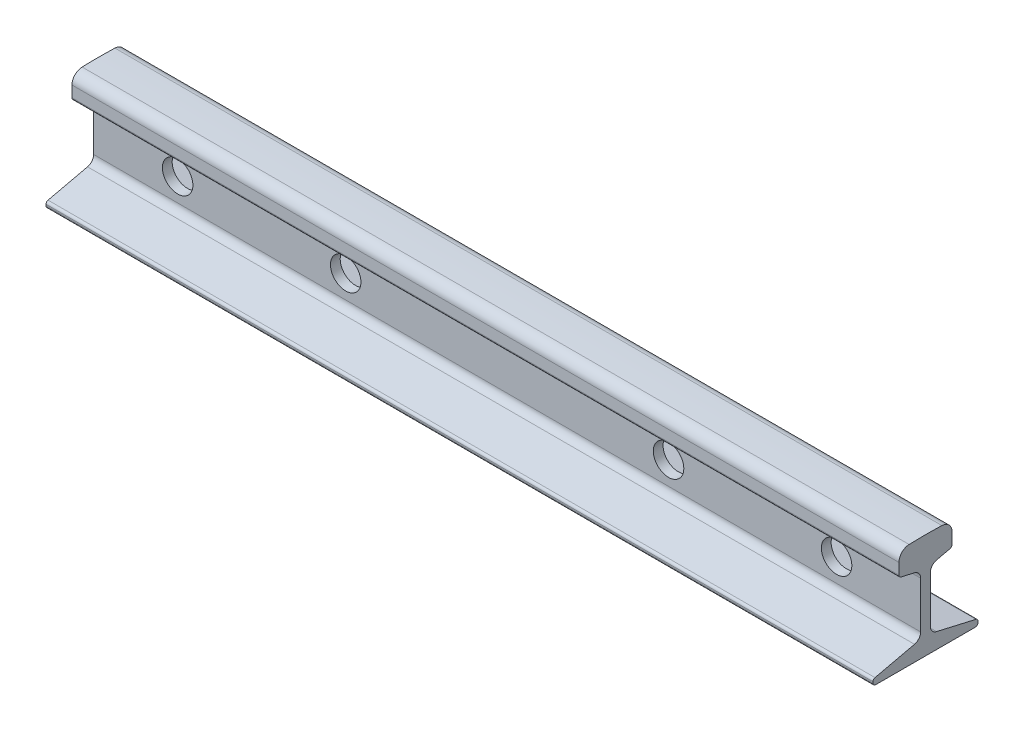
ISO-10303-21;
HEADER;
FILE_DESCRIPTION(('STEP AP214'),'2;1');
FILE_NAME('part.step','',(''),(''),'','','');
FILE_SCHEMA(('AUTOMOTIVE_DESIGN { 1 0 10303 214 1 1 1 1 }'));
ENDSEC;
DATA;
#1=APPLICATION_CONTEXT('core data for automotive mechanical design processes');
#2=APPLICATION_PROTOCOL_DEFINITION('international standard','automotive_design',2000,#1);
#3=PRODUCT_CONTEXT('',#1,'mechanical');
#4=PRODUCT('Part','Part','',(#3));
#5=PRODUCT_RELATED_PRODUCT_CATEGORY('part','',(#4));
#6=PRODUCT_DEFINITION_FORMATION('','',#4);
#7=PRODUCT_DEFINITION_CONTEXT('part definition',#1,'design');
#8=PRODUCT_DEFINITION('design','',#6,#7);
#9=PRODUCT_DEFINITION_SHAPE('','',#8);
#10=(LENGTH_UNIT() NAMED_UNIT(*) SI_UNIT(.MILLI.,.METRE.));
#11=(NAMED_UNIT(*) PLANE_ANGLE_UNIT() SI_UNIT($,.RADIAN.));
#12=(NAMED_UNIT(*) SI_UNIT($,.STERADIAN.) SOLID_ANGLE_UNIT());
#13=UNCERTAINTY_MEASURE_WITH_UNIT(LENGTH_MEASURE(1.E-05),#10,'distance_accuracy_value','');
#14=(GEOMETRIC_REPRESENTATION_CONTEXT(3) GLOBAL_UNCERTAINTY_ASSIGNED_CONTEXT((#13)) GLOBAL_UNIT_ASSIGNED_CONTEXT((#10,
#11,#12)) REPRESENTATION_CONTEXT('',''));
#15=CARTESIAN_POINT('',(0.,0.,0.));
#16=DIRECTION('',(0.,0.,1.));
#17=DIRECTION('',(1.,0.,0.));
#18=AXIS2_PLACEMENT_3D('',#15,#16,#17);
#19=CARTESIAN_POINT('',(500.,-241.3,0.));
#20=DIRECTION('',(-1.,0.,0.));
#21=DIRECTION('',(0.,0.,1.));
#22=AXIS2_PLACEMENT_3D('',#19,#20,#21);
#23=CYLINDRICAL_SURFACE('',#22,304.8);
#24=CARTESIAN_POINT('',(500.,-241.3,0.));
#25=DIRECTION('',(1.,0.,0.));
#26=DIRECTION('',(0.,0.,1.));
#27=AXIS2_PLACEMENT_3D('',#24,#25,#26);
#28=CIRCLE('',#27,304.8);
#29=CARTESIAN_POINT('',(500.,63.3389725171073,-9.90638297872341));
#30=VERTEX_POINT('',#29);
#31=CARTESIAN_POINT('',(500.,63.3389725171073,9.90638297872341));
#32=VERTEX_POINT('',#31);
#33=EDGE_CURVE('E225',#30,#32,#28,.T.);
#34=ORIENTED_EDGE('',*,*,#33,.F.);
#35=DIRECTION('',(-1.,0.,0.));
#36=VECTOR('',#35,1.);
#37=CARTESIAN_POINT('',(500.,63.3389725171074,-9.90638297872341));
#38=LINE('',#37,#36);
#39=CARTESIAN_POINT('',(0.,63.3389725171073,-9.90638297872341));
#40=VERTEX_POINT('',#39);
#41=EDGE_CURVE('E206',#30,#40,#38,.T.);
#42=ORIENTED_EDGE('',*,*,#41,.T.);
#43=CARTESIAN_POINT('',(0.,-241.3,0.));
#44=DIRECTION('',(1.,0.,0.));
#45=DIRECTION('',(0.,0.,1.));
#46=AXIS2_PLACEMENT_3D('',#43,#44,#45);
#47=CIRCLE('',#46,304.8);
#48=CARTESIAN_POINT('',(0.,63.3389725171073,9.90638297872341));
#49=VERTEX_POINT('',#48);
#50=EDGE_CURVE('E219',#40,#49,#47,.T.);
#51=ORIENTED_EDGE('',*,*,#50,.T.);
#52=DIRECTION('',(-1.,0.,0.));
#53=VECTOR('',#52,1.);
#54=CARTESIAN_POINT('',(500.,63.3389725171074,9.90638297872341));
#55=LINE('',#54,#53);
#56=EDGE_CURVE('E221',#49,#32,#55,.F.);
#57=ORIENTED_EDGE('',*,*,#56,.T.);
#58=EDGE_LOOP('',(#34,#42,#51,#57));
#59=FACE_BOUND('',#58,.T.);
#60=ADVANCED_FACE('F39',(#59),#23,.T.);
#61=CARTESIAN_POINT('',(500.,63.0771303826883,16.05));
#62=DIRECTION('',(0.,0.,-1.));
#63=DIRECTION('',(0.,1.,0.));
#64=AXIS2_PLACEMENT_3D('',#61,#62,#63);
#65=PLANE('',#64);
#66=DIRECTION('',(0.,-1.,0.));
#67=VECTOR('',#66,1.);
#68=CARTESIAN_POINT('',(0.,63.0771303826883,16.05));
#69=LINE('',#68,#67);
#70=CARTESIAN_POINT('',(0.,56.9923272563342,16.05));
#71=VERTEX_POINT('',#70);
#72=CARTESIAN_POINT('',(0.,50.3091164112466,16.05));
#73=VERTEX_POINT('',#72);
#74=EDGE_CURVE('E227',#71,#73,#69,.T.);
#75=ORIENTED_EDGE('',*,*,#74,.T.);
#76=DIRECTION('',(-1.,0.,0.));
#77=VECTOR('',#76,1.);
#78=CARTESIAN_POINT('',(500.,50.3091164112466,16.05));
#79=LINE('',#78,#77);
#80=CARTESIAN_POINT('',(500.,50.3091164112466,16.05));
#81=VERTEX_POINT('',#80);
#82=EDGE_CURVE('E348',#73,#81,#79,.F.);
#83=ORIENTED_EDGE('',*,*,#82,.T.);
#84=DIRECTION('',(0.,-1.,0.));
#85=VECTOR('',#84,1.);
#86=CARTESIAN_POINT('',(500.,63.0771303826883,16.05));
#87=LINE('',#86,#85);
#88=CARTESIAN_POINT('',(500.,56.9923272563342,16.05));
#89=VERTEX_POINT('',#88);
#90=EDGE_CURVE('E383',#89,#81,#87,.T.);
#91=ORIENTED_EDGE('',*,*,#90,.F.);
#92=DIRECTION('',(-1.,0.,0.));
#93=VECTOR('',#92,1.);
#94=CARTESIAN_POINT('',(500.,56.9923272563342,16.05));
#95=LINE('',#94,#93);
#96=EDGE_CURVE('E275',#89,#71,#95,.T.);
#97=ORIENTED_EDGE('',*,*,#96,.T.);
#98=EDGE_LOOP('',(#75,#83,#91,#97));
#99=FACE_BOUND('',#98,.T.);
#100=ADVANCED_FACE('F439',(#99),#65,.F.);
#101=CARTESIAN_POINT('',(500.,49.0443733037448,16.05));
#102=DIRECTION('',(0.,0.974370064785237,-0.224951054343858));
#103=DIRECTION('',(0.,0.224951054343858,0.974370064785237));
#104=AXIS2_PLACEMENT_3D('',#101,#102,#103);
#105=PLANE('',#104);
#106=DIRECTION('',(0.,-0.224951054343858,-0.974370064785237));
#107=VECTOR('',#106,1.);
#108=CARTESIAN_POINT('',(500.,49.0443733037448,16.05));
#109=LINE('',#108,#107);
#110=CARTESIAN_POINT('',(500.,48.7598680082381,14.8176721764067));
#111=VERTEX_POINT('',#110);
#112=CARTESIAN_POINT('',(500.,46.8717265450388,6.63923298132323));
#113=VERTEX_POINT('',#112);
#114=EDGE_CURVE('E386',#111,#113,#109,.T.);
#115=ORIENTED_EDGE('',*,*,#114,.F.);
#116=DIRECTION('',(-1.,0.,0.));
#117=VECTOR('',#116,1.);
#118=CARTESIAN_POINT('',(500.,48.7598680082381,14.8176721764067));
#119=LINE('',#118,#117);
#120=CARTESIAN_POINT('',(0.,48.7598680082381,14.8176721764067));
#121=VERTEX_POINT('',#120);
#122=EDGE_CURVE('E341',#111,#121,#119,.T.);
#123=ORIENTED_EDGE('',*,*,#122,.T.);
#124=DIRECTION('',(0.,-0.224951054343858,-0.974370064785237));
#125=VECTOR('',#124,1.);
#126=CARTESIAN_POINT('',(0.,49.0443733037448,16.05));
#127=LINE('',#126,#125);
#128=CARTESIAN_POINT('',(0.,46.8717265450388,6.63923298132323));
#129=VERTEX_POINT('',#128);
#130=EDGE_CURVE('E233',#121,#129,#127,.T.);
#131=ORIENTED_EDGE('',*,*,#130,.T.);
#132=DIRECTION('',(-1.,0.,0.));
#133=VECTOR('',#132,1.);
#134=CARTESIAN_POINT('',(500.,46.8717265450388,6.63923298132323));
#135=LINE('',#134,#133);
#136=EDGE_CURVE('E293',#129,#113,#135,.F.);
#137=ORIENTED_EDGE('',*,*,#136,.T.);
#138=EDGE_LOOP('',(#115,#123,#131,#137));
#139=FACE_BOUND('',#138,.T.);
#140=ADVANCED_FACE('F447',(#139),#105,.F.);
#141=CARTESIAN_POINT('',(500.,46.02,2.95));
#142=DIRECTION('',(0.,0.,-1.));
#143=DIRECTION('',(0.,1.,0.));
#144=AXIS2_PLACEMENT_3D('',#141,#142,#143);
#145=PLANE('',#144);
#146=CARTESIAN_POINT('',(449.20363202,27.9989725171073,2.94999999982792));
#147=DIRECTION('',(0.,0.,1.));
#148=DIRECTION('',(1.,0.,0.));
#149=AXIS2_PLACEMENT_3D('',#146,#147,#148);
#150=CIRCLE('',#149,9.21725547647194);
#151=CARTESIAN_POINT('',(458.420887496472,27.9989725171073,2.94999999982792));
#152=VERTEX_POINT('',#151);
#153=EDGE_CURVE('E378',#152,#152,#150,.T.);
#154=ORIENTED_EDGE('',*,*,#153,.F.);
#155=EDGE_LOOP('',(#154));
#156=FACE_BOUND('',#155,.T.);
#157=CARTESIAN_POINT('',(347.60363202,27.9989725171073,2.94999999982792));
#158=DIRECTION('',(0.,0.,1.));
#159=DIRECTION('',(1.,0.,0.));
#160=AXIS2_PLACEMENT_3D('',#157,#158,#159);
#161=CIRCLE('',#160,9.21725547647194);
#162=CARTESIAN_POINT('',(356.820887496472,27.9989725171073,2.94999999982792));
#163=VERTEX_POINT('',#162);
#164=EDGE_CURVE('E367',#163,#163,#161,.T.);
#165=ORIENTED_EDGE('',*,*,#164,.F.);
#166=EDGE_LOOP('',(#165));
#167=FACE_BOUND('',#166,.T.);
#168=CARTESIAN_POINT('',(152.39636798,27.9989725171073,2.94999999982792));
#169=DIRECTION('',(0.,0.,1.));
#170=DIRECTION('',(1.,0.,0.));
#171=AXIS2_PLACEMENT_3D('',#168,#169,#170);
#172=CIRCLE('',#171,9.21725547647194);
#173=CARTESIAN_POINT('',(161.613623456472,27.9989725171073,2.94999999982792));
#174=VERTEX_POINT('',#173);
#175=EDGE_CURVE('E366',#174,#174,#172,.T.);
#176=ORIENTED_EDGE('',*,*,#175,.F.);
#177=EDGE_LOOP('',(#176));
#178=FACE_BOUND('',#177,.T.);
#179=CARTESIAN_POINT('',(50.79636798,27.9989725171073,2.94999999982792));
#180=DIRECTION('',(0.,0.,1.));
#181=DIRECTION('',(1.,0.,0.));
#182=AXIS2_PLACEMENT_3D('',#179,#180,#181);
#183=CIRCLE('',#182,9.21725547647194);
#184=CARTESIAN_POINT('',(60.0136234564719,27.9989725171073,2.94999999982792));
#185=VERTEX_POINT('',#184);
#186=EDGE_CURVE('E234',#185,#185,#183,.T.);
#187=ORIENTED_EDGE('',*,*,#186,.F.);
#188=EDGE_LOOP('',(#187));
#189=FACE_BOUND('',#188,.T.);
#190=DIRECTION('',(0.,-1.,0.));
#191=VECTOR('',#190,1.);
#192=CARTESIAN_POINT('',(500.,46.02,2.95));
#193=LINE('',#192,#191);
#194=CARTESIAN_POINT('',(500.,42.2337250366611,2.95));
#195=VERTEX_POINT('',#194);
#196=CARTESIAN_POINT('',(500.,14.0862749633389,2.95));
#197=VERTEX_POINT('',#196);
#198=EDGE_CURVE('E389',#195,#197,#193,.T.);
#199=ORIENTED_EDGE('',*,*,#198,.F.);
#200=DIRECTION('',(-1.,0.,0.));
#201=VECTOR('',#200,1.);
#202=CARTESIAN_POINT('',(0.,42.2337250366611,2.95));
#203=LINE('',#202,#201);
#204=CARTESIAN_POINT('',(0.,42.2337250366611,2.95));
#205=VERTEX_POINT('',#204);
#206=EDGE_CURVE('E286',#195,#205,#203,.T.);
#207=ORIENTED_EDGE('',*,*,#206,.T.);
#208=DIRECTION('',(0.,-1.,0.));
#209=VECTOR('',#208,1.);
#210=CARTESIAN_POINT('',(0.,46.02,2.95));
#211=LINE('',#210,#209);
#212=CARTESIAN_POINT('',(0.,14.0862749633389,2.95));
#213=VERTEX_POINT('',#212);
#214=EDGE_CURVE('E241',#205,#213,#211,.T.);
#215=ORIENTED_EDGE('',*,*,#214,.T.);
#216=DIRECTION('',(-1.,0.,0.));
#217=VECTOR('',#216,1.);
#218=CARTESIAN_POINT('',(500.,14.0862749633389,2.95));
#219=LINE('',#218,#217);
#220=EDGE_CURVE('E288',#213,#197,#219,.F.);
#221=ORIENTED_EDGE('',*,*,#220,.T.);
#222=EDGE_LOOP('',(#199,#207,#215,#221));
#223=FACE_BOUND('',#222,.T.);
#224=ADVANCED_FACE('F474',(#156,#167,#178,#189,#223),#145,.F.);
#225=CARTESIAN_POINT('',(500.,10.3,2.95));
#226=DIRECTION('',(0.,-0.974370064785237,-0.224951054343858));
#227=DIRECTION('',(0.,0.224951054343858,-0.974370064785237));
#228=AXIS2_PLACEMENT_3D('',#225,#226,#227);
#229=PLANE('',#228);
#230=DIRECTION('',(0.,-0.224951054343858,0.974370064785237));
#231=VECTOR('',#230,1.);
#232=CARTESIAN_POINT('',(0.,10.3,2.95));
#233=LINE('',#232,#231);
#234=CARTESIAN_POINT('',(0.,9.44827345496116,6.63923298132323));
#235=VERTEX_POINT('',#234);
#236=CARTESIAN_POINT('',(0.,3.93550139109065,30.5176721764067));
#237=VERTEX_POINT('',#236);
#238=EDGE_CURVE('E242',#235,#237,#233,.T.);
#239=ORIENTED_EDGE('',*,*,#238,.T.);
#240=DIRECTION('',(-1.,0.,0.));
#241=VECTOR('',#240,1.);
#242=CARTESIAN_POINT('',(500.,3.93550139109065,30.5176721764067));
#243=LINE('',#242,#241);
#244=CARTESIAN_POINT('',(500.,3.93550139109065,30.5176721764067));
#245=VERTEX_POINT('',#244);
#246=EDGE_CURVE('E11',#237,#245,#243,.F.);
#247=ORIENTED_EDGE('',*,*,#246,.T.);
#248=DIRECTION('',(0.,-0.224951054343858,0.974370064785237));
#249=VECTOR('',#248,1.);
#250=CARTESIAN_POINT('',(500.,10.3,2.95));
#251=LINE('',#250,#249);
#252=CARTESIAN_POINT('',(500.,9.44827345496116,6.63923298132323));
#253=VERTEX_POINT('',#252);
#254=EDGE_CURVE('E391',#253,#245,#251,.T.);
#255=ORIENTED_EDGE('',*,*,#254,.F.);
#256=DIRECTION('',(-1.,0.,0.));
#257=VECTOR('',#256,1.);
#258=CARTESIAN_POINT('',(0.,9.44827345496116,6.63923298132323));
#259=LINE('',#258,#257);
#260=EDGE_CURVE('E295',#253,#235,#259,.T.);
#261=ORIENTED_EDGE('',*,*,#260,.T.);
#262=EDGE_LOOP('',(#239,#247,#255,#261));
#263=FACE_BOUND('',#262,.T.);
#264=ADVANCED_FACE('F485',(#263),#229,.F.);
#265=CARTESIAN_POINT('',(500.,3.65099609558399,31.75));
#266=DIRECTION('',(0.,0.,-1.));
#267=DIRECTION('',(-1.,0.,0.));
#268=AXIS2_PLACEMENT_3D('',#265,#266,#267);
#269=PLANE('',#268);
#270=DIRECTION('',(0.,-1.,0.));
#271=VECTOR('',#270,1.);
#272=CARTESIAN_POINT('',(0.,3.65099609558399,31.75));
#273=LINE('',#272,#271);
#274=CARTESIAN_POINT('',(0.,2.38625298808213,31.75));
#275=VERTEX_POINT('',#274);
#276=CARTESIAN_POINT('',(0.,1.59,31.75));
#277=VERTEX_POINT('',#276);
#278=EDGE_CURVE('E250',#275,#277,#273,.T.);
#279=ORIENTED_EDGE('',*,*,#278,.T.);
#280=DIRECTION('',(-1.,0.,0.));
#281=VECTOR('',#280,1.);
#282=CARTESIAN_POINT('',(500.,1.59,31.75));
#283=LINE('',#282,#281);
#284=CARTESIAN_POINT('',(500.,1.59,31.75));
#285=VERTEX_POINT('',#284);
#286=EDGE_CURVE('E48',#277,#285,#283,.F.);
#287=ORIENTED_EDGE('',*,*,#286,.T.);
#288=DIRECTION('',(0.,-1.,0.));
#289=VECTOR('',#288,1.);
#290=CARTESIAN_POINT('',(500.,3.65099609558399,31.75));
#291=LINE('',#290,#289);
#292=CARTESIAN_POINT('',(500.,2.38625298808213,31.75));
#293=VERTEX_POINT('',#292);
#294=EDGE_CURVE('E398',#293,#285,#291,.T.);
#295=ORIENTED_EDGE('',*,*,#294,.F.);
#296=DIRECTION('',(-1.,0.,0.));
#297=VECTOR('',#296,1.);
#298=CARTESIAN_POINT('',(500.,2.38625298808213,31.75));
#299=LINE('',#298,#297);
#300=EDGE_CURVE('E359',#293,#275,#299,.T.);
#301=ORIENTED_EDGE('',*,*,#300,.T.);
#302=EDGE_LOOP('',(#279,#287,#295,#301));
#303=FACE_BOUND('',#302,.T.);
#304=ADVANCED_FACE('F489',(#303),#269,.F.);
#305=CARTESIAN_POINT('',(500.,0.,-31.75));
#306=DIRECTION('',(0.,1.,0.));
#307=DIRECTION('',(0.,0.,1.));
#308=AXIS2_PLACEMENT_3D('',#305,#306,#307);
#309=PLANE('',#308);
#310=DIRECTION('',(0.,0.,-1.));
#311=VECTOR('',#310,1.);
#312=CARTESIAN_POINT('',(0.,0.,-31.75));
#313=LINE('',#312,#311);
#314=CARTESIAN_POINT('',(0.,0.,30.16));
#315=VERTEX_POINT('',#314);
#316=CARTESIAN_POINT('',(0.,0.,-30.16));
#317=VERTEX_POINT('',#316);
#318=EDGE_CURVE('E249',#315,#317,#313,.T.);
#319=ORIENTED_EDGE('',*,*,#318,.T.);
#320=DIRECTION('',(-1.,0.,0.));
#321=VECTOR('',#320,1.);
#322=CARTESIAN_POINT('',(500.,0.,-30.16));
#323=LINE('',#322,#321);
#324=CARTESIAN_POINT('',(500.,0.,-30.16));
#325=VERTEX_POINT('',#324);
#326=EDGE_CURVE('E352',#317,#325,#323,.F.);
#327=ORIENTED_EDGE('',*,*,#326,.T.);
#328=DIRECTION('',(0.,0.,-1.));
#329=VECTOR('',#328,1.);
#330=CARTESIAN_POINT('',(500.,0.,-31.75));
#331=LINE('',#330,#329);
#332=CARTESIAN_POINT('',(500.,0.,30.16));
#333=VERTEX_POINT('',#332);
#334=EDGE_CURVE('E399',#333,#325,#331,.T.);
#335=ORIENTED_EDGE('',*,*,#334,.F.);
#336=DIRECTION('',(-1.,0.,0.));
#337=VECTOR('',#336,1.);
#338=CARTESIAN_POINT('',(500.,0.,30.16));
#339=LINE('',#338,#337);
#340=EDGE_CURVE('E355',#333,#315,#339,.T.);
#341=ORIENTED_EDGE('',*,*,#340,.T.);
#342=EDGE_LOOP('',(#319,#327,#335,#341));
#343=FACE_BOUND('',#342,.T.);
#344=ADVANCED_FACE('F497',(#343),#309,.F.);
#345=CARTESIAN_POINT('',(500.,3.65099609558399,-31.75));
#346=DIRECTION('',(0.,0.,1.));
#347=DIRECTION('',(1.,0.,0.));
#348=AXIS2_PLACEMENT_3D('',#345,#346,#347);
#349=PLANE('',#348);
#350=DIRECTION('',(0.,1.,0.));
#351=VECTOR('',#350,1.);
#352=CARTESIAN_POINT('',(500.,3.65099609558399,-31.75));
#353=LINE('',#352,#351);
#354=CARTESIAN_POINT('',(500.,1.59,-31.75));
#355=VERTEX_POINT('',#354);
#356=CARTESIAN_POINT('',(500.,2.38625298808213,-31.75));
#357=VERTEX_POINT('',#356);
#358=EDGE_CURVE('E405',#355,#357,#353,.T.);
#359=ORIENTED_EDGE('',*,*,#358,.F.);
#360=DIRECTION('',(-1.,0.,0.));
#361=VECTOR('',#360,1.);
#362=CARTESIAN_POINT('',(500.,1.59,-31.75));
#363=LINE('',#362,#361);
#364=CARTESIAN_POINT('',(0.,1.59,-31.75));
#365=VERTEX_POINT('',#364);
#366=EDGE_CURVE('E349',#355,#365,#363,.T.);
#367=ORIENTED_EDGE('',*,*,#366,.T.);
#368=DIRECTION('',(0.,1.,0.));
#369=VECTOR('',#368,1.);
#370=CARTESIAN_POINT('',(0.,3.65099609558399,-31.75));
#371=LINE('',#370,#369);
#372=CARTESIAN_POINT('',(0.,2.38625298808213,-31.75));
#373=VERTEX_POINT('',#372);
#374=EDGE_CURVE('E254',#365,#373,#371,.T.);
#375=ORIENTED_EDGE('',*,*,#374,.T.);
#376=DIRECTION('',(-1.,0.,0.));
#377=VECTOR('',#376,1.);
#378=CARTESIAN_POINT('',(500.,2.38625298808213,-31.75));
#379=LINE('',#378,#377);
#380=EDGE_CURVE('E62',#373,#357,#379,.F.);
#381=ORIENTED_EDGE('',*,*,#380,.T.);
#382=EDGE_LOOP('',(#359,#367,#375,#381));
#383=FACE_BOUND('',#382,.T.);
#384=ADVANCED_FACE('F502',(#383),#349,.F.);
#385=CARTESIAN_POINT('',(500.,10.3,-2.95));
#386=DIRECTION('',(0.,-0.974370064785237,0.224951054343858));
#387=DIRECTION('',(0.,-0.224951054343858,-0.974370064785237));
#388=AXIS2_PLACEMENT_3D('',#385,#386,#387);
#389=PLANE('',#388);
#390=DIRECTION('',(0.,0.224951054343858,0.974370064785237));
#391=VECTOR('',#390,1.);
#392=CARTESIAN_POINT('',(500.,10.3,-2.95));
#393=LINE('',#392,#391);
#394=CARTESIAN_POINT('',(500.,3.93550139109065,-30.5176721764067));
#395=VERTEX_POINT('',#394);
#396=CARTESIAN_POINT('',(500.,9.44827345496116,-6.63923298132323));
#397=VERTEX_POINT('',#396);
#398=EDGE_CURVE('E404',#395,#397,#393,.T.);
#399=ORIENTED_EDGE('',*,*,#398,.F.);
#400=DIRECTION('',(-1.,0.,0.));
#401=VECTOR('',#400,1.);
#402=CARTESIAN_POINT('',(500.,3.93550139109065,-30.5176721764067));
#403=LINE('',#402,#401);
#404=CARTESIAN_POINT('',(0.,3.93550139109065,-30.5176721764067));
#405=VERTEX_POINT('',#404);
#406=EDGE_CURVE('E357',#395,#405,#403,.T.);
#407=ORIENTED_EDGE('',*,*,#406,.T.);
#408=DIRECTION('',(0.,0.224951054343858,0.974370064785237));
#409=VECTOR('',#408,1.);
#410=CARTESIAN_POINT('',(0.,10.3,-2.95));
#411=LINE('',#410,#409);
#412=CARTESIAN_POINT('',(0.,9.44827345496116,-6.63923298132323));
#413=VERTEX_POINT('',#412);
#414=EDGE_CURVE('E253',#405,#413,#411,.T.);
#415=ORIENTED_EDGE('',*,*,#414,.T.);
#416=DIRECTION('',(-1.,0.,0.));
#417=VECTOR('',#416,1.);
#418=CARTESIAN_POINT('',(500.,9.44827345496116,-6.63923298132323));
#419=LINE('',#418,#417);
#420=EDGE_CURVE('E281',#413,#397,#419,.F.);
#421=ORIENTED_EDGE('',*,*,#420,.T.);
#422=EDGE_LOOP('',(#399,#407,#415,#421));
#423=FACE_BOUND('',#422,.T.);
#424=ADVANCED_FACE('F512',(#423),#389,.F.);
#425=CARTESIAN_POINT('',(500.,46.02,-2.95));
#426=DIRECTION('',(0.,0.,1.));
#427=DIRECTION('',(0.,-1.,0.));
#428=AXIS2_PLACEMENT_3D('',#425,#426,#427);
#429=PLANE('',#428);
#430=CARTESIAN_POINT('',(449.20363202,27.9989725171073,-2.95));
#431=DIRECTION('',(0.,0.,1.));
#432=DIRECTION('',(0.,-1.,0.));
#433=AXIS2_PLACEMENT_3D('',#430,#431,#432);
#434=CIRCLE('',#433,9.21725547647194);
#435=CARTESIAN_POINT('',(449.20363202,18.7817170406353,-2.95));
#436=VERTEX_POINT('',#435);
#437=EDGE_CURVE('E43',#436,#436,#434,.T.);
#438=ORIENTED_EDGE('',*,*,#437,.T.);
#439=EDGE_LOOP('',(#438));
#440=FACE_BOUND('',#439,.T.);
#441=CARTESIAN_POINT('',(347.60363202,27.9989725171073,-2.95));
#442=DIRECTION('',(0.,0.,1.));
#443=DIRECTION('',(0.,-1.,0.));
#444=AXIS2_PLACEMENT_3D('',#441,#442,#443);
#445=CIRCLE('',#444,9.21725547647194);
#446=CARTESIAN_POINT('',(347.60363202,18.7817170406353,-2.95));
#447=VERTEX_POINT('',#446);
#448=EDGE_CURVE('E370',#447,#447,#445,.T.);
#449=ORIENTED_EDGE('',*,*,#448,.T.);
#450=EDGE_LOOP('',(#449));
#451=FACE_BOUND('',#450,.T.);
#452=CARTESIAN_POINT('',(152.39636798,27.9989725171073,-2.95));
#453=DIRECTION('',(0.,0.,1.));
#454=DIRECTION('',(0.,-1.,0.));
#455=AXIS2_PLACEMENT_3D('',#452,#453,#454);
#456=CIRCLE('',#455,9.21725547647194);
#457=CARTESIAN_POINT('',(152.39636798,18.7817170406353,-2.95));
#458=VERTEX_POINT('',#457);
#459=EDGE_CURVE('E364',#458,#458,#456,.T.);
#460=ORIENTED_EDGE('',*,*,#459,.T.);
#461=EDGE_LOOP('',(#460));
#462=FACE_BOUND('',#461,.T.);
#463=CARTESIAN_POINT('',(50.79636798,27.9989725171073,-2.95));
#464=DIRECTION('',(0.,0.,1.));
#465=DIRECTION('',(0.,-1.,0.));
#466=AXIS2_PLACEMENT_3D('',#463,#464,#465);
#467=CIRCLE('',#466,9.21725547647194);
#468=CARTESIAN_POINT('',(50.79636798,18.7817170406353,-2.95));
#469=VERTEX_POINT('',#468);
#470=EDGE_CURVE('E226',#469,#469,#467,.T.);
#471=ORIENTED_EDGE('',*,*,#470,.T.);
#472=EDGE_LOOP('',(#471));
#473=FACE_BOUND('',#472,.T.);
#474=DIRECTION('',(0.,1.,0.));
#475=VECTOR('',#474,1.);
#476=CARTESIAN_POINT('',(0.,46.02,-2.95));
#477=LINE('',#476,#475);
#478=CARTESIAN_POINT('',(0.,14.0862749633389,-2.95));
#479=VERTEX_POINT('',#478);
#480=CARTESIAN_POINT('',(0.,42.2337250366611,-2.95));
#481=VERTEX_POINT('',#480);
#482=EDGE_CURVE('E260',#479,#481,#477,.T.);
#483=ORIENTED_EDGE('',*,*,#482,.T.);
#484=DIRECTION('',(-1.,0.,0.));
#485=VECTOR('',#484,1.);
#486=CARTESIAN_POINT('',(500.,42.2337250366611,-2.95));
#487=LINE('',#486,#485);
#488=CARTESIAN_POINT('',(500.,42.2337250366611,-2.95));
#489=VERTEX_POINT('',#488);
#490=EDGE_CURVE('E283',#481,#489,#487,.F.);
#491=ORIENTED_EDGE('',*,*,#490,.T.);
#492=DIRECTION('',(0.,1.,0.));
#493=VECTOR('',#492,1.);
#494=CARTESIAN_POINT('',(500.,46.02,-2.95));
#495=LINE('',#494,#493);
#496=CARTESIAN_POINT('',(500.,14.0862749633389,-2.95));
#497=VERTEX_POINT('',#496);
#498=EDGE_CURVE('E408',#497,#489,#495,.T.);
#499=ORIENTED_EDGE('',*,*,#498,.F.);
#500=DIRECTION('',(-1.,0.,0.));
#501=VECTOR('',#500,1.);
#502=CARTESIAN_POINT('',(0.,14.0862749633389,-2.95));
#503=LINE('',#502,#501);
#504=EDGE_CURVE('E276',#497,#479,#503,.T.);
#505=ORIENTED_EDGE('',*,*,#504,.T.);
#506=EDGE_LOOP('',(#483,#491,#499,#505));
#507=FACE_BOUND('',#506,.T.);
#508=ADVANCED_FACE('F516',(#440,#451,#462,#473,#507),#429,.F.);
#509=CARTESIAN_POINT('',(500.,49.0443733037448,-16.05));
#510=DIRECTION('',(0.,0.974370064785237,0.224951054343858));
#511=DIRECTION('',(0.,-0.224951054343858,0.974370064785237));
#512=AXIS2_PLACEMENT_3D('',#509,#510,#511);
#513=PLANE('',#512);
#514=DIRECTION('',(0.,0.224951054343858,-0.974370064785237));
#515=VECTOR('',#514,1.);
#516=CARTESIAN_POINT('',(0.,49.0443733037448,-16.05));
#517=LINE('',#516,#515);
#518=CARTESIAN_POINT('',(0.,46.8717265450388,-6.63923298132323));
#519=VERTEX_POINT('',#518);
#520=CARTESIAN_POINT('',(0.,48.7598680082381,-14.8176721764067));
#521=VERTEX_POINT('',#520);
#522=EDGE_CURVE('E259',#519,#521,#517,.T.);
#523=ORIENTED_EDGE('',*,*,#522,.T.);
#524=DIRECTION('',(-1.,0.,0.));
#525=VECTOR('',#524,1.);
#526=CARTESIAN_POINT('',(500.,48.7598680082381,-14.8176721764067));
#527=LINE('',#526,#525);
#528=CARTESIAN_POINT('',(500.,48.7598680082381,-14.8176721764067));
#529=VERTEX_POINT('',#528);
#530=EDGE_CURVE('E327',#521,#529,#527,.F.);
#531=ORIENTED_EDGE('',*,*,#530,.T.);
#532=DIRECTION('',(0.,0.224951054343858,-0.974370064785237));
#533=VECTOR('',#532,1.);
#534=CARTESIAN_POINT('',(500.,49.0443733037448,-16.05));
#535=LINE('',#534,#533);
#536=CARTESIAN_POINT('',(500.,46.8717265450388,-6.63923298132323));
#537=VERTEX_POINT('',#536);
#538=EDGE_CURVE('E406',#537,#529,#535,.T.);
#539=ORIENTED_EDGE('',*,*,#538,.F.);
#540=DIRECTION('',(-1.,0.,0.));
#541=VECTOR('',#540,1.);
#542=CARTESIAN_POINT('',(0.,46.8717265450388,-6.63923298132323));
#543=LINE('',#542,#541);
#544=EDGE_CURVE('E273',#537,#519,#543,.T.);
#545=ORIENTED_EDGE('',*,*,#544,.T.);
#546=EDGE_LOOP('',(#523,#531,#539,#545));
#547=FACE_BOUND('',#546,.T.);
#548=ADVANCED_FACE('F423',(#547),#513,.F.);
#549=CARTESIAN_POINT('',(500.,63.0771303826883,-16.05));
#550=DIRECTION('',(0.,0.,1.));
#551=DIRECTION('',(0.,-1.,0.));
#552=AXIS2_PLACEMENT_3D('',#549,#550,#551);
#553=PLANE('',#552);
#554=DIRECTION('',(0.,1.,0.));
#555=VECTOR('',#554,1.);
#556=CARTESIAN_POINT('',(500.,63.0771303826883,-16.05));
#557=LINE('',#556,#555);
#558=CARTESIAN_POINT('',(500.,50.3091164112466,-16.05));
#559=VERTEX_POINT('',#558);
#560=CARTESIAN_POINT('',(500.,56.9923272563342,-16.05));
#561=VERTEX_POINT('',#560);
#562=EDGE_CURVE('E240',#559,#561,#557,.T.);
#563=ORIENTED_EDGE('',*,*,#562,.F.);
#564=DIRECTION('',(-1.,0.,0.));
#565=VECTOR('',#564,1.);
#566=CARTESIAN_POINT('',(500.,50.3091164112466,-16.05));
#567=LINE('',#566,#565);
#568=CARTESIAN_POINT('',(0.,50.3091164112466,-16.05));
#569=VERTEX_POINT('',#568);
#570=EDGE_CURVE('E314',#559,#569,#567,.T.);
#571=ORIENTED_EDGE('',*,*,#570,.T.);
#572=DIRECTION('',(0.,1.,0.));
#573=VECTOR('',#572,1.);
#574=CARTESIAN_POINT('',(0.,63.0771303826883,-16.05));
#575=LINE('',#574,#573);
#576=CARTESIAN_POINT('',(0.,56.9923272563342,-16.05));
#577=VERTEX_POINT('',#576);
#578=EDGE_CURVE('E261',#569,#577,#575,.T.);
#579=ORIENTED_EDGE('',*,*,#578,.T.);
#580=DIRECTION('',(-1.,0.,0.));
#581=VECTOR('',#580,1.);
#582=CARTESIAN_POINT('',(500.,56.9923272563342,-16.05));
#583=LINE('',#582,#581);
#584=EDGE_CURVE('E208',#577,#561,#583,.F.);
#585=ORIENTED_EDGE('',*,*,#584,.T.);
#586=EDGE_LOOP('',(#563,#571,#579,#585));
#587=FACE_BOUND('',#586,.T.);
#588=ADVANCED_FACE('F418',(#587),#553,.F.);
#589=CARTESIAN_POINT('',(500.,-241.3,0.));
#590=DIRECTION('',(-1.,0.,0.));
#591=DIRECTION('',(0.,0.,1.));
#592=AXIS2_PLACEMENT_3D('',#589,#590,#591);
#593=PLANE('',#592);
#594=ORIENTED_EDGE('',*,*,#538,.T.);
#595=CARTESIAN_POINT('',(500.,50.3091164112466,-14.46));
#596=DIRECTION('',(-1.,0.,0.));
#597=DIRECTION('',(0.,0.,1.));
#598=AXIS2_PLACEMENT_3D('',#595,#596,#597);
#599=CIRCLE('',#598,1.59);
#600=EDGE_CURVE('E343',#529,#559,#599,.F.);
#601=ORIENTED_EDGE('',*,*,#600,.T.);
#602=ORIENTED_EDGE('',*,*,#562,.T.);
#603=CARTESIAN_POINT('',(500.,56.9923272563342,-9.7));
#604=DIRECTION('',(-1.,0.,0.));
#605=DIRECTION('',(0.,0.,1.));
#606=AXIS2_PLACEMENT_3D('',#603,#604,#605);
#607=CIRCLE('',#606,6.35);
#608=EDGE_CURVE('E267',#561,#30,#607,.F.);
#609=ORIENTED_EDGE('',*,*,#608,.T.);
#610=ORIENTED_EDGE('',*,*,#33,.T.);
#611=CARTESIAN_POINT('',(500.,56.9923272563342,9.7));
#612=DIRECTION('',(-1.,0.,0.));
#613=DIRECTION('',(0.,0.,1.));
#614=AXIS2_PLACEMENT_3D('',#611,#612,#613);
#615=CIRCLE('',#614,6.35);
#616=EDGE_CURVE('E266',#32,#89,#615,.F.);
#617=ORIENTED_EDGE('',*,*,#616,.T.);
#618=ORIENTED_EDGE('',*,*,#90,.T.);
#619=CARTESIAN_POINT('',(500.,50.3091164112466,14.46));
#620=DIRECTION('',(-1.,0.,0.));
#621=DIRECTION('',(0.,0.,1.));
#622=AXIS2_PLACEMENT_3D('',#619,#620,#621);
#623=CIRCLE('',#622,1.59);
#624=EDGE_CURVE('E339',#81,#111,#623,.F.);
#625=ORIENTED_EDGE('',*,*,#624,.T.);
#626=ORIENTED_EDGE('',*,*,#114,.T.);
#627=CARTESIAN_POINT('',(500.,42.2337250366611,7.71));
#628=DIRECTION('',(-1.,0.,0.));
#629=DIRECTION('',(0.,0.,1.));
#630=AXIS2_PLACEMENT_3D('',#627,#628,#629);
#631=CIRCLE('',#630,4.76);
#632=EDGE_CURVE('E307',#113,#195,#631,.T.);
#633=ORIENTED_EDGE('',*,*,#632,.T.);
#634=ORIENTED_EDGE('',*,*,#198,.T.);
#635=CARTESIAN_POINT('',(500.,14.0862749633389,7.71));
#636=DIRECTION('',(-1.,0.,0.));
#637=DIRECTION('',(0.,0.,1.));
#638=AXIS2_PLACEMENT_3D('',#635,#636,#637);
#639=CIRCLE('',#638,4.76);
#640=EDGE_CURVE('E312',#197,#253,#639,.T.);
#641=ORIENTED_EDGE('',*,*,#640,.T.);
#642=ORIENTED_EDGE('',*,*,#254,.T.);
#643=CARTESIAN_POINT('',(500.,2.38625298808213,30.16));
#644=DIRECTION('',(-1.,0.,0.));
#645=DIRECTION('',(0.,0.,1.));
#646=AXIS2_PLACEMENT_3D('',#643,#644,#645);
#647=CIRCLE('',#646,1.59);
#648=EDGE_CURVE('E335',#245,#293,#647,.F.);
#649=ORIENTED_EDGE('',*,*,#648,.T.);
#650=ORIENTED_EDGE('',*,*,#294,.T.);
#651=CARTESIAN_POINT('',(500.,1.59,30.16));
#652=DIRECTION('',(-1.,0.,0.));
#653=DIRECTION('',(0.,0.,1.));
#654=AXIS2_PLACEMENT_3D('',#651,#652,#653);
#655=CIRCLE('',#654,1.59);
#656=EDGE_CURVE('E334',#285,#333,#655,.F.);
#657=ORIENTED_EDGE('',*,*,#656,.T.);
#658=ORIENTED_EDGE('',*,*,#334,.T.);
#659=CARTESIAN_POINT('',(500.,1.59,-30.16));
#660=DIRECTION('',(-1.,0.,0.));
#661=DIRECTION('',(0.,0.,1.));
#662=AXIS2_PLACEMENT_3D('',#659,#660,#661);
#663=CIRCLE('',#662,1.59);
#664=EDGE_CURVE('E340',#325,#355,#663,.F.);
#665=ORIENTED_EDGE('',*,*,#664,.T.);
#666=ORIENTED_EDGE('',*,*,#358,.T.);
#667=CARTESIAN_POINT('',(500.,2.38625298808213,-30.16));
#668=DIRECTION('',(-1.,0.,0.));
#669=DIRECTION('',(0.,0.,1.));
#670=AXIS2_PLACEMENT_3D('',#667,#668,#669);
#671=CIRCLE('',#670,1.59);
#672=EDGE_CURVE('E57',#357,#395,#671,.F.);
#673=ORIENTED_EDGE('',*,*,#672,.T.);
#674=ORIENTED_EDGE('',*,*,#398,.T.);
#675=CARTESIAN_POINT('',(500.,14.0862749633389,-7.71));
#676=DIRECTION('',(-1.,0.,0.));
#677=DIRECTION('',(0.,0.,1.));
#678=AXIS2_PLACEMENT_3D('',#675,#676,#677);
#679=CIRCLE('',#678,4.76);
#680=EDGE_CURVE('E302',#397,#497,#679,.T.);
#681=ORIENTED_EDGE('',*,*,#680,.T.);
#682=ORIENTED_EDGE('',*,*,#498,.T.);
#683=CARTESIAN_POINT('',(500.,42.2337250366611,-7.71));
#684=DIRECTION('',(-1.,0.,0.));
#685=DIRECTION('',(0.,0.,1.));
#686=AXIS2_PLACEMENT_3D('',#683,#684,#685);
#687=CIRCLE('',#686,4.76);
#688=EDGE_CURVE('E299',#489,#537,#687,.T.);
#689=ORIENTED_EDGE('',*,*,#688,.T.);
#690=EDGE_LOOP('',(#594,#601,#602,#609,#610,#617,#618,#625,#626,#633,#634,#641,#642,#649,#650,
#657,#658,#665,#666,#673,#674,#681,#682,#689));
#691=FACE_BOUND('',#690,.T.);
#692=ADVANCED_FACE('F411',(#691),#593,.F.);
#693=CARTESIAN_POINT('',(0.,-241.3,0.));
#694=DIRECTION('',(-1.,0.,0.));
#695=DIRECTION('',(0.,0.,1.));
#696=AXIS2_PLACEMENT_3D('',#693,#694,#695);
#697=PLANE('',#696);
#698=ORIENTED_EDGE('',*,*,#578,.F.);
#699=CARTESIAN_POINT('',(0.,50.3091164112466,-14.46));
#700=DIRECTION('',(-1.,0.,0.));
#701=DIRECTION('',(0.,0.,1.));
#702=AXIS2_PLACEMENT_3D('',#699,#700,#701);
#703=CIRCLE('',#702,1.59);
#704=EDGE_CURVE('E326',#569,#521,#703,.T.);
#705=ORIENTED_EDGE('',*,*,#704,.T.);
#706=ORIENTED_EDGE('',*,*,#522,.F.);
#707=CARTESIAN_POINT('',(0.,42.2337250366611,-7.71));
#708=DIRECTION('',(-1.,0.,0.));
#709=DIRECTION('',(0.,0.,1.));
#710=AXIS2_PLACEMENT_3D('',#707,#708,#709);
#711=CIRCLE('',#710,4.76);
#712=EDGE_CURVE('E300',#519,#481,#711,.F.);
#713=ORIENTED_EDGE('',*,*,#712,.T.);
#714=ORIENTED_EDGE('',*,*,#482,.F.);
#715=CARTESIAN_POINT('',(0.,14.0862749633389,-7.71));
#716=DIRECTION('',(-1.,0.,0.));
#717=DIRECTION('',(0.,0.,1.));
#718=AXIS2_PLACEMENT_3D('',#715,#716,#717);
#719=CIRCLE('',#718,4.76);
#720=EDGE_CURVE('E301',#479,#413,#719,.F.);
#721=ORIENTED_EDGE('',*,*,#720,.T.);
#722=ORIENTED_EDGE('',*,*,#414,.F.);
#723=CARTESIAN_POINT('',(0.,2.38625298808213,-30.16));
#724=DIRECTION('',(-1.,0.,0.));
#725=DIRECTION('',(0.,0.,1.));
#726=AXIS2_PLACEMENT_3D('',#723,#724,#725);
#727=CIRCLE('',#726,1.59);
#728=EDGE_CURVE('E325',#405,#373,#727,.T.);
#729=ORIENTED_EDGE('',*,*,#728,.T.);
#730=ORIENTED_EDGE('',*,*,#374,.F.);
#731=CARTESIAN_POINT('',(0.,1.59,-30.16));
#732=DIRECTION('',(-1.,0.,0.));
#733=DIRECTION('',(0.,0.,1.));
#734=AXIS2_PLACEMENT_3D('',#731,#732,#733);
#735=CIRCLE('',#734,1.59);
#736=EDGE_CURVE('E322',#365,#317,#735,.T.);
#737=ORIENTED_EDGE('',*,*,#736,.T.);
#738=ORIENTED_EDGE('',*,*,#318,.F.);
#739=CARTESIAN_POINT('',(0.,1.59,30.16));
#740=DIRECTION('',(-1.,0.,0.));
#741=DIRECTION('',(0.,0.,1.));
#742=AXIS2_PLACEMENT_3D('',#739,#740,#741);
#743=CIRCLE('',#742,1.59);
#744=EDGE_CURVE('E318',#315,#277,#743,.T.);
#745=ORIENTED_EDGE('',*,*,#744,.T.);
#746=ORIENTED_EDGE('',*,*,#278,.F.);
#747=CARTESIAN_POINT('',(0.,2.38625298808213,30.16));
#748=DIRECTION('',(-1.,0.,0.));
#749=DIRECTION('',(0.,0.,1.));
#750=AXIS2_PLACEMENT_3D('',#747,#748,#749);
#751=CIRCLE('',#750,1.59);
#752=EDGE_CURVE('E319',#275,#237,#751,.T.);
#753=ORIENTED_EDGE('',*,*,#752,.T.);
#754=ORIENTED_EDGE('',*,*,#238,.F.);
#755=CARTESIAN_POINT('',(0.,14.0862749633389,7.71));
#756=DIRECTION('',(-1.,0.,0.));
#757=DIRECTION('',(0.,0.,1.));
#758=AXIS2_PLACEMENT_3D('',#755,#756,#757);
#759=CIRCLE('',#758,4.76);
#760=EDGE_CURVE('E311',#235,#213,#759,.F.);
#761=ORIENTED_EDGE('',*,*,#760,.T.);
#762=ORIENTED_EDGE('',*,*,#214,.F.);
#763=CARTESIAN_POINT('',(0.,42.2337250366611,7.71));
#764=DIRECTION('',(-1.,0.,0.));
#765=DIRECTION('',(0.,0.,1.));
#766=AXIS2_PLACEMENT_3D('',#763,#764,#765);
#767=CIRCLE('',#766,4.76);
#768=EDGE_CURVE('E306',#205,#129,#767,.F.);
#769=ORIENTED_EDGE('',*,*,#768,.T.);
#770=ORIENTED_EDGE('',*,*,#130,.F.);
#771=CARTESIAN_POINT('',(0.,50.3091164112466,14.46));
#772=DIRECTION('',(-1.,0.,0.));
#773=DIRECTION('',(0.,0.,1.));
#774=AXIS2_PLACEMENT_3D('',#771,#772,#773);
#775=CIRCLE('',#774,1.59);
#776=EDGE_CURVE('E328',#121,#73,#775,.T.);
#777=ORIENTED_EDGE('',*,*,#776,.T.);
#778=ORIENTED_EDGE('',*,*,#74,.F.);
#779=CARTESIAN_POINT('',(0.,56.9923272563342,9.7));
#780=DIRECTION('',(-1.,0.,0.));
#781=DIRECTION('',(0.,0.,1.));
#782=AXIS2_PLACEMENT_3D('',#779,#780,#781);
#783=CIRCLE('',#782,6.35);
#784=EDGE_CURVE('E212',#71,#49,#783,.T.);
#785=ORIENTED_EDGE('',*,*,#784,.T.);
#786=ORIENTED_EDGE('',*,*,#50,.F.);
#787=CARTESIAN_POINT('',(0.,56.9923272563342,-9.7));
#788=DIRECTION('',(-1.,0.,0.));
#789=DIRECTION('',(0.,0.,1.));
#790=AXIS2_PLACEMENT_3D('',#787,#788,#789);
#791=CIRCLE('',#790,6.35);
#792=EDGE_CURVE('E204',#40,#577,#791,.T.);
#793=ORIENTED_EDGE('',*,*,#792,.T.);
#794=EDGE_LOOP('',(#698,#705,#706,#713,#714,#721,#722,#729,#730,#737,#738,#745,#746,#753,#754,
#761,#762,#769,#770,#777,#778,#785,#786,#793));
#795=FACE_BOUND('',#794,.T.);
#796=ADVANCED_FACE('F222',(#795),#697,.T.);
#797=CARTESIAN_POINT('',(500.,56.9923272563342,-9.7));
#798=DIRECTION('',(-1.,0.,0.));
#799=DIRECTION('',(0.,0.,1.));
#800=AXIS2_PLACEMENT_3D('',#797,#798,#799);
#801=CYLINDRICAL_SURFACE('',#800,6.35);
#802=ORIENTED_EDGE('',*,*,#608,.F.);
#803=ORIENTED_EDGE('',*,*,#584,.F.);
#804=ORIENTED_EDGE('',*,*,#792,.F.);
#805=ORIENTED_EDGE('',*,*,#41,.F.);
#806=EDGE_LOOP('',(#802,#803,#804,#805));
#807=FACE_BOUND('',#806,.T.);
#808=ADVANCED_FACE('F210',(#807),#801,.T.);
#809=CARTESIAN_POINT('',(500.,56.9923272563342,9.7));
#810=DIRECTION('',(-1.,0.,0.));
#811=DIRECTION('',(0.,0.,1.));
#812=AXIS2_PLACEMENT_3D('',#809,#810,#811);
#813=CYLINDRICAL_SURFACE('',#812,6.35);
#814=ORIENTED_EDGE('',*,*,#616,.F.);
#815=ORIENTED_EDGE('',*,*,#56,.F.);
#816=ORIENTED_EDGE('',*,*,#784,.F.);
#817=ORIENTED_EDGE('',*,*,#96,.F.);
#818=EDGE_LOOP('',(#814,#815,#816,#817));
#819=FACE_BOUND('',#818,.T.);
#820=ADVANCED_FACE('F455',(#819),#813,.T.);
#821=CARTESIAN_POINT('',(500.,42.2337250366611,-7.71));
#822=DIRECTION('',(1.,0.,0.));
#823=DIRECTION('',(0.,0.,-1.));
#824=AXIS2_PLACEMENT_3D('',#821,#822,#823);
#825=CYLINDRICAL_SURFACE('',#824,4.76);
#826=ORIENTED_EDGE('',*,*,#688,.F.);
#827=ORIENTED_EDGE('',*,*,#490,.F.);
#828=ORIENTED_EDGE('',*,*,#712,.F.);
#829=ORIENTED_EDGE('',*,*,#544,.F.);
#830=EDGE_LOOP('',(#826,#827,#828,#829));
#831=FACE_BOUND('',#830,.T.);
#832=ADVANCED_FACE('F454',(#831),#825,.F.);
#833=CARTESIAN_POINT('',(500.,14.0862749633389,-7.71));
#834=DIRECTION('',(1.,0.,0.));
#835=DIRECTION('',(0.,0.,-1.));
#836=AXIS2_PLACEMENT_3D('',#833,#834,#835);
#837=CYLINDRICAL_SURFACE('',#836,4.76);
#838=ORIENTED_EDGE('',*,*,#680,.F.);
#839=ORIENTED_EDGE('',*,*,#420,.F.);
#840=ORIENTED_EDGE('',*,*,#720,.F.);
#841=ORIENTED_EDGE('',*,*,#504,.F.);
#842=EDGE_LOOP('',(#838,#839,#840,#841));
#843=FACE_BOUND('',#842,.T.);
#844=ADVANCED_FACE('F459',(#843),#837,.F.);
#845=CARTESIAN_POINT('',(500.,42.2337250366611,7.71));
#846=DIRECTION('',(1.,0.,0.));
#847=DIRECTION('',(0.,0.,-1.));
#848=AXIS2_PLACEMENT_3D('',#845,#846,#847);
#849=CYLINDRICAL_SURFACE('',#848,4.76);
#850=ORIENTED_EDGE('',*,*,#632,.F.);
#851=ORIENTED_EDGE('',*,*,#136,.F.);
#852=ORIENTED_EDGE('',*,*,#768,.F.);
#853=ORIENTED_EDGE('',*,*,#206,.F.);
#854=EDGE_LOOP('',(#850,#851,#852,#853));
#855=FACE_BOUND('',#854,.T.);
#856=ADVANCED_FACE('F436',(#855),#849,.F.);
#857=CARTESIAN_POINT('',(500.,14.0862749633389,7.71));
#858=DIRECTION('',(1.,0.,0.));
#859=DIRECTION('',(0.,0.,-1.));
#860=AXIS2_PLACEMENT_3D('',#857,#858,#859);
#861=CYLINDRICAL_SURFACE('',#860,4.76);
#862=ORIENTED_EDGE('',*,*,#640,.F.);
#863=ORIENTED_EDGE('',*,*,#220,.F.);
#864=ORIENTED_EDGE('',*,*,#760,.F.);
#865=ORIENTED_EDGE('',*,*,#260,.F.);
#866=EDGE_LOOP('',(#862,#863,#864,#865));
#867=FACE_BOUND('',#866,.T.);
#868=ADVANCED_FACE('F428',(#867),#861,.F.);
#869=CARTESIAN_POINT('',(500.,50.3091164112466,-14.46));
#870=DIRECTION('',(-1.,0.,0.));
#871=DIRECTION('',(0.,0.,1.));
#872=AXIS2_PLACEMENT_3D('',#869,#870,#871);
#873=CYLINDRICAL_SURFACE('',#872,1.59);
#874=ORIENTED_EDGE('',*,*,#600,.F.);
#875=ORIENTED_EDGE('',*,*,#530,.F.);
#876=ORIENTED_EDGE('',*,*,#704,.F.);
#877=ORIENTED_EDGE('',*,*,#570,.F.);
#878=EDGE_LOOP('',(#874,#875,#876,#877));
#879=FACE_BOUND('',#878,.T.);
#880=ADVANCED_FACE('F421',(#879),#873,.T.);
#881=CARTESIAN_POINT('',(500.,50.3091164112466,14.46));
#882=DIRECTION('',(-1.,0.,0.));
#883=DIRECTION('',(0.,0.,1.));
#884=AXIS2_PLACEMENT_3D('',#881,#882,#883);
#885=CYLINDRICAL_SURFACE('',#884,1.59);
#886=ORIENTED_EDGE('',*,*,#624,.F.);
#887=ORIENTED_EDGE('',*,*,#82,.F.);
#888=ORIENTED_EDGE('',*,*,#776,.F.);
#889=ORIENTED_EDGE('',*,*,#122,.F.);
#890=EDGE_LOOP('',(#886,#887,#888,#889));
#891=FACE_BOUND('',#890,.T.);
#892=ADVANCED_FACE('F424',(#891),#885,.T.);
#893=CARTESIAN_POINT('',(500.,1.59,-30.16));
#894=DIRECTION('',(-1.,0.,0.));
#895=DIRECTION('',(0.,0.,1.));
#896=AXIS2_PLACEMENT_3D('',#893,#894,#895);
#897=CYLINDRICAL_SURFACE('',#896,1.59);
#898=ORIENTED_EDGE('',*,*,#664,.F.);
#899=ORIENTED_EDGE('',*,*,#326,.F.);
#900=ORIENTED_EDGE('',*,*,#736,.F.);
#901=ORIENTED_EDGE('',*,*,#366,.F.);
#902=EDGE_LOOP('',(#898,#899,#900,#901));
#903=FACE_BOUND('',#902,.T.);
#904=ADVANCED_FACE('F435',(#903),#897,.T.);
#905=CARTESIAN_POINT('',(500.,2.38625298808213,-30.16));
#906=DIRECTION('',(-1.,0.,0.));
#907=DIRECTION('',(0.,0.,1.));
#908=AXIS2_PLACEMENT_3D('',#905,#906,#907);
#909=CYLINDRICAL_SURFACE('',#908,1.59);
#910=ORIENTED_EDGE('',*,*,#672,.F.);
#911=ORIENTED_EDGE('',*,*,#380,.F.);
#912=ORIENTED_EDGE('',*,*,#728,.F.);
#913=ORIENTED_EDGE('',*,*,#406,.F.);
#914=EDGE_LOOP('',(#910,#911,#912,#913));
#915=FACE_BOUND('',#914,.T.);
#916=ADVANCED_FACE('F508',(#915),#909,.T.);
#917=CARTESIAN_POINT('',(500.,1.59,30.16));
#918=DIRECTION('',(-1.,0.,0.));
#919=DIRECTION('',(0.,0.,1.));
#920=AXIS2_PLACEMENT_3D('',#917,#918,#919);
#921=CYLINDRICAL_SURFACE('',#920,1.59);
#922=ORIENTED_EDGE('',*,*,#656,.F.);
#923=ORIENTED_EDGE('',*,*,#286,.F.);
#924=ORIENTED_EDGE('',*,*,#744,.F.);
#925=ORIENTED_EDGE('',*,*,#340,.F.);
#926=EDGE_LOOP('',(#922,#923,#924,#925));
#927=FACE_BOUND('',#926,.T.);
#928=ADVANCED_FACE('F494',(#927),#921,.T.);
#929=CARTESIAN_POINT('',(500.,2.38625298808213,30.16));
#930=DIRECTION('',(-1.,0.,0.));
#931=DIRECTION('',(0.,0.,1.));
#932=AXIS2_PLACEMENT_3D('',#929,#930,#931);
#933=CYLINDRICAL_SURFACE('',#932,1.59);
#934=ORIENTED_EDGE('',*,*,#648,.F.);
#935=ORIENTED_EDGE('',*,*,#246,.F.);
#936=ORIENTED_EDGE('',*,*,#752,.F.);
#937=ORIENTED_EDGE('',*,*,#300,.F.);
#938=EDGE_LOOP('',(#934,#935,#936,#937));
#939=FACE_BOUND('',#938,.T.);
#940=ADVANCED_FACE('F41',(#939),#933,.T.);
#941=CARTESIAN_POINT('',(50.79636798,27.9989725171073,-31.75));
#942=DIRECTION('',(0.,0.,1.));
#943=DIRECTION('',(1.,0.,0.));
#944=AXIS2_PLACEMENT_3D('',#941,#942,#943);
#945=CYLINDRICAL_SURFACE('',#944,9.21725547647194);
#946=ORIENTED_EDGE('',*,*,#186,.T.);
#947=EDGE_LOOP('',(#946));
#948=FACE_BOUND('',#947,.T.);
#949=ORIENTED_EDGE('',*,*,#470,.F.);
#950=EDGE_LOOP('',(#949));
#951=FACE_BOUND('',#950,.T.);
#952=ADVANCED_FACE('F681',(#948,#951),#945,.F.);
#953=CARTESIAN_POINT('',(152.39636798,27.9989725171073,-31.75));
#954=DIRECTION('',(0.,0.,1.));
#955=DIRECTION('',(1.,0.,0.));
#956=AXIS2_PLACEMENT_3D('',#953,#954,#955);
#957=CYLINDRICAL_SURFACE('',#956,9.21725547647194);
#958=ORIENTED_EDGE('',*,*,#175,.T.);
#959=EDGE_LOOP('',(#958));
#960=FACE_BOUND('',#959,.T.);
#961=ORIENTED_EDGE('',*,*,#459,.F.);
#962=EDGE_LOOP('',(#961));
#963=FACE_BOUND('',#962,.T.);
#964=ADVANCED_FACE('F687',(#960,#963),#957,.F.);
#965=CARTESIAN_POINT('',(347.60363202,27.9989725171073,-31.75));
#966=DIRECTION('',(0.,0.,1.));
#967=DIRECTION('',(1.,0.,0.));
#968=AXIS2_PLACEMENT_3D('',#965,#966,#967);
#969=CYLINDRICAL_SURFACE('',#968,9.21725547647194);
#970=ORIENTED_EDGE('',*,*,#164,.T.);
#971=EDGE_LOOP('',(#970));
#972=FACE_BOUND('',#971,.T.);
#973=ORIENTED_EDGE('',*,*,#448,.F.);
#974=EDGE_LOOP('',(#973));
#975=FACE_BOUND('',#974,.T.);
#976=ADVANCED_FACE('F699',(#972,#975),#969,.F.);
#977=CARTESIAN_POINT('',(449.20363202,27.9989725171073,-31.75));
#978=DIRECTION('',(0.,0.,1.));
#979=DIRECTION('',(1.,0.,0.));
#980=AXIS2_PLACEMENT_3D('',#977,#978,#979);
#981=CYLINDRICAL_SURFACE('',#980,9.21725547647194);
#982=ORIENTED_EDGE('',*,*,#153,.T.);
#983=EDGE_LOOP('',(#982));
#984=FACE_BOUND('',#983,.T.);
#985=ORIENTED_EDGE('',*,*,#437,.F.);
#986=EDGE_LOOP('',(#985));
#987=FACE_BOUND('',#986,.T.);
#988=ADVANCED_FACE('F708',(#984,#987),#981,.F.);
#989=CLOSED_SHELL('',(#60,#100,#140,#224,#264,#304,#344,#384,#424,#508,#548,#588,#692,#796,#808,
#820,#832,#844,#856,#868,#880,#892,#904,#916,#928,#940,#952,#964,#976,#988));
#990=MANIFOLD_SOLID_BREP('B2',#989);
#991=ADVANCED_BREP_SHAPE_REPRESENTATION('',(#18,#990),#14);
#992=SHAPE_DEFINITION_REPRESENTATION(#9,#991);
ENDSEC;
END-ISO-10303-21;
